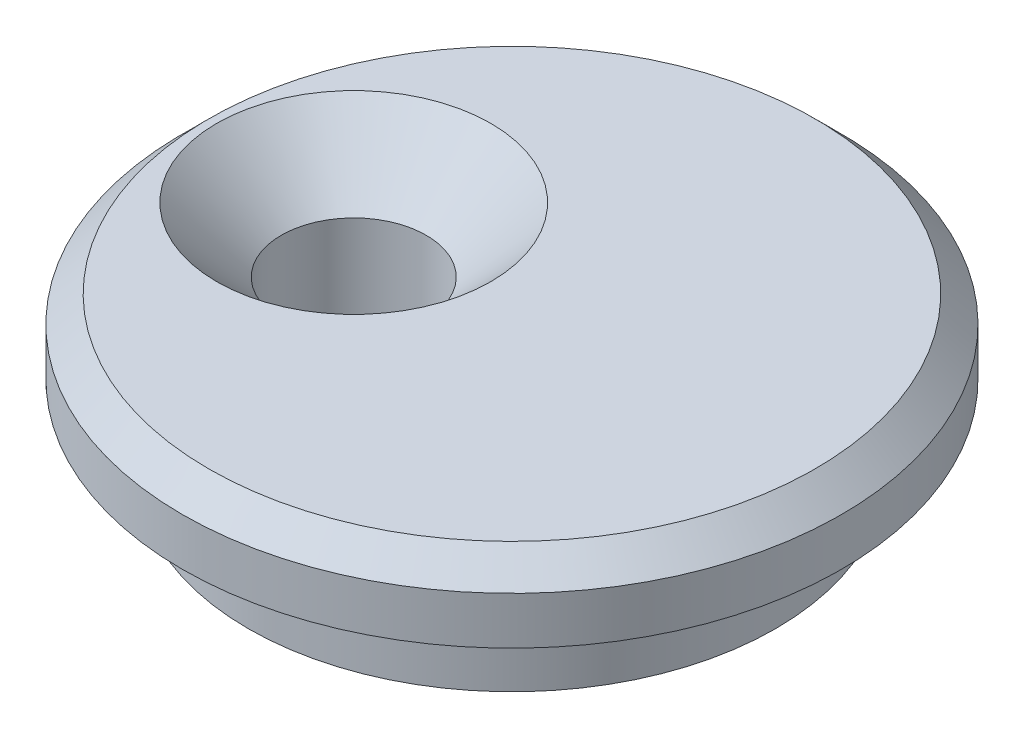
ISO-10303-21;
HEADER;
FILE_DESCRIPTION(('STEP AP214'),'2;1');
FILE_NAME('part.step','',(''),(''),'','','');
FILE_SCHEMA(('AUTOMOTIVE_DESIGN { 1 0 10303 214 1 1 1 1 }'));
ENDSEC;
DATA;
#1=APPLICATION_CONTEXT('core data for automotive mechanical design processes');
#2=APPLICATION_PROTOCOL_DEFINITION('international standard','automotive_design',2000,#1);
#3=PRODUCT_CONTEXT('',#1,'mechanical');
#4=PRODUCT('Part','Part','',(#3));
#5=PRODUCT_RELATED_PRODUCT_CATEGORY('part','',(#4));
#6=PRODUCT_DEFINITION_FORMATION('','',#4);
#7=PRODUCT_DEFINITION_CONTEXT('part definition',#1,'design');
#8=PRODUCT_DEFINITION('design','',#6,#7);
#9=PRODUCT_DEFINITION_SHAPE('','',#8);
#10=(LENGTH_UNIT() NAMED_UNIT(*) SI_UNIT(.MILLI.,.METRE.));
#11=(NAMED_UNIT(*) PLANE_ANGLE_UNIT() SI_UNIT($,.RADIAN.));
#12=(NAMED_UNIT(*) SI_UNIT($,.STERADIAN.) SOLID_ANGLE_UNIT());
#13=UNCERTAINTY_MEASURE_WITH_UNIT(LENGTH_MEASURE(1.E-05),#10,'distance_accuracy_value','');
#14=(GEOMETRIC_REPRESENTATION_CONTEXT(3) GLOBAL_UNCERTAINTY_ASSIGNED_CONTEXT((#13)) GLOBAL_UNIT_ASSIGNED_CONTEXT((#10,
#11,#12)) REPRESENTATION_CONTEXT('',''));
#15=CARTESIAN_POINT('',(0.,0.,0.));
#16=DIRECTION('',(0.,0.,1.));
#17=DIRECTION('',(1.,0.,0.));
#18=AXIS2_PLACEMENT_3D('',#15,#16,#17);
#19=CARTESIAN_POINT('',(0.,-6.,0.));
#20=DIRECTION('',(0.,-1.,0.));
#21=DIRECTION('',(0.,0.,-1.));
#22=AXIS2_PLACEMENT_3D('',#19,#20,#21);
#23=PLANE('',#22);
#24=CARTESIAN_POINT('',(0.,-6.,0.));
#25=DIRECTION('',(0.,-1.,0.));
#26=DIRECTION('',(0.,0.,-1.));
#27=AXIS2_PLACEMENT_3D('',#24,#25,#26);
#28=CIRCLE('',#27,10.);
#29=CARTESIAN_POINT('',(0.,-6.,-10.));
#30=VERTEX_POINT('',#29);
#31=EDGE_CURVE('E49',#30,#30,#28,.T.);
#32=ORIENTED_EDGE('',*,*,#31,.T.);
#33=EDGE_LOOP('',(#32));
#34=FACE_BOUND('',#33,.T.);
#35=CARTESIAN_POINT('',(-6.,-6.,0.));
#36=DIRECTION('',(0.,1.,0.));
#37=DIRECTION('',(0.,0.,1.));
#38=AXIS2_PLACEMENT_3D('',#35,#36,#37);
#39=CIRCLE('',#38,2.75);
#40=CARTESIAN_POINT('',(-6.,-6.,2.75));
#41=VERTEX_POINT('',#40);
#42=EDGE_CURVE('E52',#41,#41,#39,.T.);
#43=ORIENTED_EDGE('',*,*,#42,.T.);
#44=EDGE_LOOP('',(#43));
#45=FACE_BOUND('',#44,.T.);
#46=ADVANCED_FACE('F29',(#34,#45),#23,.T.);
#47=CARTESIAN_POINT('',(0.,-2.8,0.));
#48=DIRECTION('',(0.,1.,0.));
#49=DIRECTION('',(0.,0.,1.));
#50=AXIS2_PLACEMENT_3D('',#47,#48,#49);
#51=PLANE('',#50);
#52=CARTESIAN_POINT('',(0.,-2.8,0.));
#53=DIRECTION('',(0.,1.,0.));
#54=DIRECTION('',(0.,0.,1.));
#55=AXIS2_PLACEMENT_3D('',#52,#53,#54);
#56=CIRCLE('',#55,12.5);
#57=CARTESIAN_POINT('',(0.,-2.8,12.5));
#58=VERTEX_POINT('',#57);
#59=EDGE_CURVE('E44',#58,#58,#56,.T.);
#60=ORIENTED_EDGE('',*,*,#59,.F.);
#61=EDGE_LOOP('',(#60));
#62=FACE_BOUND('',#61,.T.);
#63=CARTESIAN_POINT('',(0.,-2.8,0.));
#64=DIRECTION('',(0.,1.,0.));
#65=DIRECTION('',(0.,0.,1.));
#66=AXIS2_PLACEMENT_3D('',#63,#64,#65);
#67=CIRCLE('',#66,10.);
#68=CARTESIAN_POINT('',(0.,-2.8,10.));
#69=VERTEX_POINT('',#68);
#70=EDGE_CURVE('E10',#69,#69,#67,.F.);
#71=ORIENTED_EDGE('',*,*,#70,.F.);
#72=EDGE_LOOP('',(#71));
#73=FACE_BOUND('',#72,.T.);
#74=ADVANCED_FACE('F81',(#62,#73),#51,.F.);
#75=CARTESIAN_POINT('',(0.,-2.8,0.));
#76=DIRECTION('',(0.,1.,0.));
#77=DIRECTION('',(0.,0.,1.));
#78=AXIS2_PLACEMENT_3D('',#75,#76,#77);
#79=CYLINDRICAL_SURFACE('',#78,12.5);
#80=CARTESIAN_POINT('',(0.,-0.999999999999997,0.));
#81=DIRECTION('',(0.,1.,0.));
#82=DIRECTION('',(0.,0.,1.));
#83=AXIS2_PLACEMENT_3D('',#80,#81,#82);
#84=CIRCLE('',#83,12.5);
#85=CARTESIAN_POINT('',(0.,-0.999999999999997,12.5));
#86=VERTEX_POINT('',#85);
#87=EDGE_CURVE('E36',#86,#86,#84,.F.);
#88=ORIENTED_EDGE('',*,*,#87,.T.);
#89=EDGE_LOOP('',(#88));
#90=FACE_BOUND('',#89,.T.);
#91=ORIENTED_EDGE('',*,*,#59,.T.);
#92=EDGE_LOOP('',(#91));
#93=FACE_BOUND('',#92,.T.);
#94=ADVANCED_FACE('F67',(#90,#93),#79,.T.);
#95=CARTESIAN_POINT('',(0.,0.,0.));
#96=DIRECTION('',(0.,1.,0.));
#97=DIRECTION('',(0.,0.,1.));
#98=AXIS2_PLACEMENT_3D('',#95,#96,#97);
#99=PLANE('',#98);
#100=CARTESIAN_POINT('',(-6.,0.,0.));
#101=DIRECTION('',(0.,1.,0.));
#102=DIRECTION('',(0.,0.,1.));
#103=AXIS2_PLACEMENT_3D('',#100,#101,#102);
#104=CIRCLE('',#103,5.2);
#105=CARTESIAN_POINT('',(-6.,0.,5.2));
#106=VERTEX_POINT('',#105);
#107=EDGE_CURVE('E58',#106,#106,#104,.T.);
#108=ORIENTED_EDGE('',*,*,#107,.F.);
#109=EDGE_LOOP('',(#108));
#110=FACE_BOUND('',#109,.T.);
#111=CARTESIAN_POINT('',(0.,0.,0.));
#112=DIRECTION('',(0.,1.,0.));
#113=DIRECTION('',(0.,0.,1.));
#114=AXIS2_PLACEMENT_3D('',#111,#112,#113);
#115=CIRCLE('',#114,11.5);
#116=CARTESIAN_POINT('',(0.,0.,11.5));
#117=VERTEX_POINT('',#116);
#118=EDGE_CURVE('E40',#117,#117,#115,.T.);
#119=ORIENTED_EDGE('',*,*,#118,.T.);
#120=EDGE_LOOP('',(#119));
#121=FACE_BOUND('',#120,.T.);
#122=ADVANCED_FACE('F64',(#110,#121),#99,.T.);
#123=CARTESIAN_POINT('',(0.,0.,0.));
#124=DIRECTION('',(0.,-1.,0.));
#125=DIRECTION('',(0.,0.,-1.));
#126=AXIS2_PLACEMENT_3D('',#123,#124,#125);
#127=CONICAL_SURFACE('',#126,11.5,0.785398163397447);
#128=ORIENTED_EDGE('',*,*,#87,.F.);
#129=EDGE_LOOP('',(#128));
#130=FACE_BOUND('',#129,.T.);
#131=ORIENTED_EDGE('',*,*,#118,.F.);
#132=EDGE_LOOP('',(#131));
#133=FACE_BOUND('',#132,.T.);
#134=ADVANCED_FACE('F31',(#130,#133),#127,.T.);
#135=CARTESIAN_POINT('',(0.,-6.,0.));
#136=DIRECTION('',(0.,1.,0.));
#137=DIRECTION('',(0.,0.,1.));
#138=AXIS2_PLACEMENT_3D('',#135,#136,#137);
#139=CYLINDRICAL_SURFACE('',#138,10.);
#140=ORIENTED_EDGE('',*,*,#31,.F.);
#141=EDGE_LOOP('',(#140));
#142=FACE_BOUND('',#141,.T.);
#143=ORIENTED_EDGE('',*,*,#70,.T.);
#144=EDGE_LOOP('',(#143));
#145=FACE_BOUND('',#144,.T.);
#146=ADVANCED_FACE('F72',(#142,#145),#139,.T.);
#147=CARTESIAN_POINT('',(-6.,0.,0.));
#148=DIRECTION('',(0.,1.,0.));
#149=DIRECTION('',(0.,0.,1.));
#150=AXIS2_PLACEMENT_3D('',#147,#148,#149);
#151=CYLINDRICAL_SURFACE('',#150,2.75);
#152=ORIENTED_EDGE('',*,*,#42,.F.);
#153=EDGE_LOOP('',(#152));
#154=FACE_BOUND('',#153,.T.);
#155=CARTESIAN_POINT('',(-6.,-2.45,0.));
#156=DIRECTION('',(0.,1.,0.));
#157=DIRECTION('',(0.,0.,1.));
#158=AXIS2_PLACEMENT_3D('',#155,#156,#157);
#159=CIRCLE('',#158,2.75);
#160=CARTESIAN_POINT('',(-6.,-2.45,2.75));
#161=VERTEX_POINT('',#160);
#162=EDGE_CURVE('E55',#161,#161,#159,.T.);
#163=ORIENTED_EDGE('',*,*,#162,.T.);
#164=EDGE_LOOP('',(#163));
#165=FACE_BOUND('',#164,.T.);
#166=ADVANCED_FACE('F77',(#154,#165),#151,.F.);
#167=CARTESIAN_POINT('',(-6.,0.,0.));
#168=DIRECTION('',(0.,1.,0.));
#169=DIRECTION('',(0.,0.,1.));
#170=AXIS2_PLACEMENT_3D('',#167,#168,#169);
#171=CONICAL_SURFACE('',#170,5.2,0.78539816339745);
#172=ORIENTED_EDGE('',*,*,#162,.F.);
#173=EDGE_LOOP('',(#172));
#174=FACE_BOUND('',#173,.T.);
#175=ORIENTED_EDGE('',*,*,#107,.T.);
#176=EDGE_LOOP('',(#175));
#177=FACE_BOUND('',#176,.T.);
#178=ADVANCED_FACE('F62',(#174,#177),#171,.F.);
#179=CLOSED_SHELL('',(#46,#74,#94,#122,#134,#146,#166,#178));
#180=MANIFOLD_SOLID_BREP('B2',#179);
#181=ADVANCED_BREP_SHAPE_REPRESENTATION('',(#18,#180),#14);
#182=SHAPE_DEFINITION_REPRESENTATION(#9,#181);
ENDSEC;
END-ISO-10303-21;
